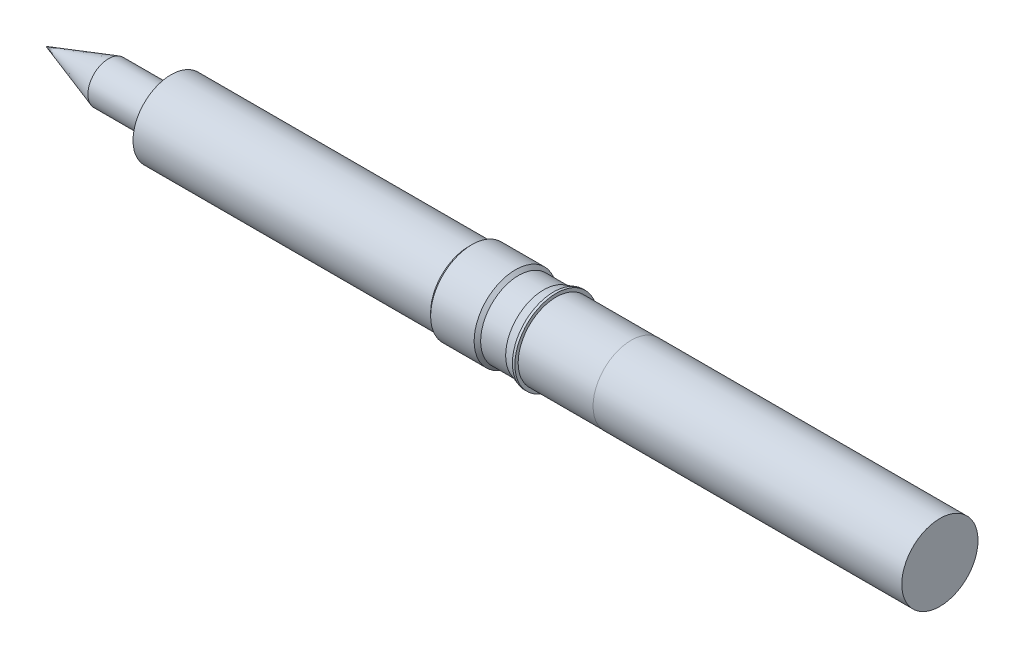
from build123d import *

# Parameters (mm, degrees)
SKETCH4_R           = 0.825
BOSS_EXTRUDE2_DEPTH = 2.5
BOSS_EXTRUDE3_START = 4.7244
SKETCH7_R           = 1.524
BOSS_EXTRUDE3_DEPTH = 4.7244


with BuildPart() as part:
    # Sketch1 → Revolve1 (revolve)
    with BuildSketch(Plane(origin=(0, 0, 0), x_dir=(-1, 0, 0), z_dir=(0, 0, -1)), mode=Mode.PRIVATE) as revolve1_sk:
        Polygon((-31.02, 1.524), (-31.02, 0), (-30.39, 0), (-5, 0), (-5, 1.52), (-16.9, 1.52), (-17.03, 1.65), (-18.77, 1.65), (-18.9, 1.52), (-19.9, 1.52), (-20.3, 1.65), (-20.4, 1.65), (-20.4, 1.52), (-23.4, 1.52), (-23.4, 1.524), align=None)
    revolve(revolve1_sk.sketch.rotate(Axis((30.39, 0, 0), (-1, 0, 0)), 270), axis=Axis((30.39, 0, 0), (-1, 0, 0)))

    # Sketch4 → Boss-Extrude2 (add)
    with BuildSketch(Plane.ZY.offset(-5)):
        Circle(SKETCH4_R)
    extrude(amount=BOSS_EXTRUDE2_DEPTH)

    # Sketch5 → Revolve2 (revolve)
    with BuildSketch(Plane(origin=(0, 0, 0), x_dir=(-1, 0, 0), z_dir=(0, 0, -1)), mode=Mode.PRIVATE) as revolve2_sk:
        Polygon((-2.5, 0.825), (-2.5, 0), (0, 0), align=None)
    revolve(revolve2_sk.sketch.rotate(Axis((2.500025, 0, 0), (-1, 0, 0)), 90), axis=Axis((2.500025, 0, 0), (-1, 0, 0)))

    # Sketch7 → Boss-Extrude3 (add)
    with BuildSketch(Plane(origin=(31.02, 0, 0), x_dir=(0, 0, -1), z_dir=(1, 0, 0)).offset(BOSS_EXTRUDE3_START)):
        with Locations(Location((0, 0, 0), (0, 0, 180))):
            Circle(SKETCH7_R)
    extrude(amount=-BOSS_EXTRUDE3_DEPTH)


solid = part.part
